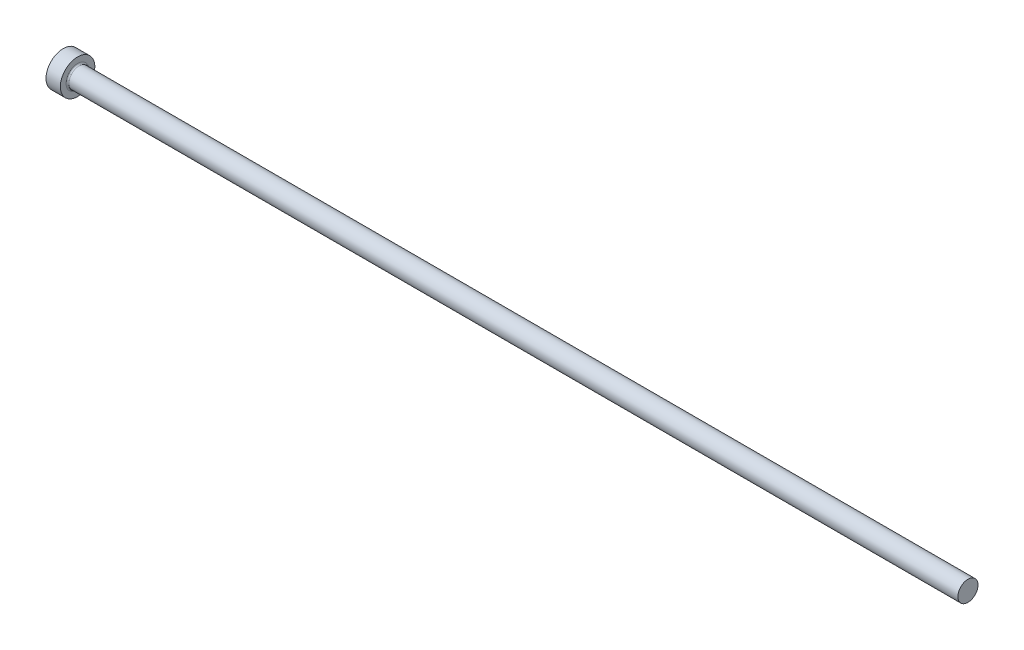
ISO-10303-21;
HEADER;
FILE_DESCRIPTION(('STEP AP214'),'2;1');
FILE_NAME('part.step','',(''),(''),'','','');
FILE_SCHEMA(('AUTOMOTIVE_DESIGN { 1 0 10303 214 1 1 1 1 }'));
ENDSEC;
DATA;
#1=APPLICATION_CONTEXT('core data for automotive mechanical design processes');
#2=APPLICATION_PROTOCOL_DEFINITION('international standard','automotive_design',2000,#1);
#3=PRODUCT_CONTEXT('',#1,'mechanical');
#4=PRODUCT('Part','Part','',(#3));
#5=PRODUCT_RELATED_PRODUCT_CATEGORY('part','',(#4));
#6=PRODUCT_DEFINITION_FORMATION('','',#4);
#7=PRODUCT_DEFINITION_CONTEXT('part definition',#1,'design');
#8=PRODUCT_DEFINITION('design','',#6,#7);
#9=PRODUCT_DEFINITION_SHAPE('','',#8);
#10=(LENGTH_UNIT() NAMED_UNIT(*) SI_UNIT(.MILLI.,.METRE.));
#11=(NAMED_UNIT(*) PLANE_ANGLE_UNIT() SI_UNIT($,.RADIAN.));
#12=(NAMED_UNIT(*) SI_UNIT($,.STERADIAN.) SOLID_ANGLE_UNIT());
#13=UNCERTAINTY_MEASURE_WITH_UNIT(LENGTH_MEASURE(1.E-05),#10,'distance_accuracy_value','');
#14=(GEOMETRIC_REPRESENTATION_CONTEXT(3) GLOBAL_UNCERTAINTY_ASSIGNED_CONTEXT((#13)) GLOBAL_UNIT_ASSIGNED_CONTEXT((#10,
#11,#12)) REPRESENTATION_CONTEXT('',''));
#15=CARTESIAN_POINT('',(0.,0.,0.));
#16=DIRECTION('',(0.,0.,1.));
#17=DIRECTION('',(1.,0.,0.));
#18=AXIS2_PLACEMENT_3D('',#15,#16,#17);
#19=CARTESIAN_POINT('',(0.,0.,0.));
#20=DIRECTION('',(-1.,0.,0.));
#21=DIRECTION('',(0.,-1.,0.));
#22=AXIS2_PLACEMENT_3D('',#19,#20,#21);
#23=PLANE('',#22);
#24=CARTESIAN_POINT('',(0.,0.,0.));
#25=DIRECTION('',(1.,0.,0.));
#26=DIRECTION('',(0.,1.,0.));
#27=AXIS2_PLACEMENT_3D('',#24,#25,#26);
#28=CIRCLE('',#27,6.);
#29=CARTESIAN_POINT('',(0.,6.,0.));
#30=VERTEX_POINT('',#29);
#31=EDGE_CURVE('E25',#30,#30,#28,.T.);
#32=ORIENTED_EDGE('',*,*,#31,.F.);
#33=EDGE_LOOP('',(#32));
#34=FACE_BOUND('',#33,.T.);
#35=ADVANCED_FACE('F14',(#34),#23,.T.);
#36=CARTESIAN_POINT('',(315.,0.,0.));
#37=DIRECTION('',(1.,0.,0.));
#38=DIRECTION('',(0.,1.,0.));
#39=AXIS2_PLACEMENT_3D('',#36,#37,#38);
#40=CYLINDRICAL_SURFACE('',#39,6.);
#41=ORIENTED_EDGE('',*,*,#31,.T.);
#42=EDGE_LOOP('',(#41));
#43=FACE_BOUND('',#42,.T.);
#44=CARTESIAN_POINT('',(5.,0.,0.));
#45=DIRECTION('',(1.,0.,0.));
#46=DIRECTION('',(0.,1.,0.));
#47=AXIS2_PLACEMENT_3D('',#44,#45,#46);
#48=CIRCLE('',#47,6.);
#49=CARTESIAN_POINT('',(5.,6.,0.));
#50=VERTEX_POINT('',#49);
#51=EDGE_CURVE('E29',#50,#50,#48,.T.);
#52=ORIENTED_EDGE('',*,*,#51,.F.);
#53=EDGE_LOOP('',(#52));
#54=FACE_BOUND('',#53,.T.);
#55=ADVANCED_FACE('F51',(#43,#54),#40,.T.);
#56=CARTESIAN_POINT('',(5.,6.,0.));
#57=DIRECTION('',(1.,0.,0.));
#58=DIRECTION('',(0.,1.,0.));
#59=AXIS2_PLACEMENT_3D('',#56,#57,#58);
#60=PLANE('',#59);
#61=CARTESIAN_POINT('',(5.,0.,0.));
#62=DIRECTION('',(1.,0.,0.));
#63=DIRECTION('',(0.,1.,0.));
#64=AXIS2_PLACEMENT_3D('',#61,#62,#63);
#65=CIRCLE('',#64,4.);
#66=CARTESIAN_POINT('',(5.,4.,0.));
#67=VERTEX_POINT('',#66);
#68=EDGE_CURVE('E9',#67,#67,#65,.F.);
#69=ORIENTED_EDGE('',*,*,#68,.T.);
#70=EDGE_LOOP('',(#69));
#71=FACE_BOUND('',#70,.T.);
#72=ORIENTED_EDGE('',*,*,#51,.T.);
#73=EDGE_LOOP('',(#72));
#74=FACE_BOUND('',#73,.T.);
#75=ADVANCED_FACE('F42',(#71,#74),#60,.T.);
#76=CARTESIAN_POINT('',(315.,0.,0.));
#77=DIRECTION('',(1.,0.,0.));
#78=DIRECTION('',(0.,1.,0.));
#79=AXIS2_PLACEMENT_3D('',#76,#77,#78);
#80=CYLINDRICAL_SURFACE('',#79,3.49999999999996);
#81=CARTESIAN_POINT('',(5.5,0.,0.));
#82=DIRECTION('',(1.,0.,0.));
#83=DIRECTION('',(0.,1.,0.));
#84=AXIS2_PLACEMENT_3D('',#81,#82,#83);
#85=CIRCLE('',#84,3.49999999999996);
#86=CARTESIAN_POINT('',(5.5,3.49999999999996,0.));
#87=VERTEX_POINT('',#86);
#88=EDGE_CURVE('E21',#87,#87,#85,.T.);
#89=ORIENTED_EDGE('',*,*,#88,.T.);
#90=EDGE_LOOP('',(#89));
#91=FACE_BOUND('',#90,.T.);
#92=CARTESIAN_POINT('',(315.,0.,0.));
#93=DIRECTION('',(1.,0.,0.));
#94=DIRECTION('',(0.,1.,0.));
#95=AXIS2_PLACEMENT_3D('',#92,#93,#94);
#96=CIRCLE('',#95,3.49999999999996);
#97=CARTESIAN_POINT('',(315.,3.49999999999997,0.));
#98=VERTEX_POINT('',#97);
#99=EDGE_CURVE('E34',#98,#98,#96,.T.);
#100=ORIENTED_EDGE('',*,*,#99,.F.);
#101=EDGE_LOOP('',(#100));
#102=FACE_BOUND('',#101,.T.);
#103=ADVANCED_FACE('F40',(#91,#102),#80,.T.);
#104=CARTESIAN_POINT('',(315.,3.5,0.));
#105=DIRECTION('',(1.,0.,0.));
#106=DIRECTION('',(0.,1.,0.));
#107=AXIS2_PLACEMENT_3D('',#104,#105,#106);
#108=PLANE('',#107);
#109=ORIENTED_EDGE('',*,*,#99,.T.);
#110=EDGE_LOOP('',(#109));
#111=FACE_BOUND('',#110,.T.);
#112=ADVANCED_FACE('F38',(#111),#108,.T.);
#113=CARTESIAN_POINT('',(5.5,0.,0.));
#114=DIRECTION('',(1.,0.,0.));
#115=DIRECTION('',(0.,1.,0.));
#116=AXIS2_PLACEMENT_3D('',#113,#114,#115);
#117=TOROIDAL_SURFACE('',#116,4.,0.5);
#118=ORIENTED_EDGE('',*,*,#68,.F.);
#119=EDGE_LOOP('',(#118));
#120=FACE_BOUND('',#119,.T.);
#121=ORIENTED_EDGE('',*,*,#88,.F.);
#122=EDGE_LOOP('',(#121));
#123=FACE_BOUND('',#122,.T.);
#124=ADVANCED_FACE('F16',(#120,#123),#117,.F.);
#125=CLOSED_SHELL('',(#35,#55,#75,#103,#112,#124));
#126=MANIFOLD_SOLID_BREP('B1',#125);
#127=ADVANCED_BREP_SHAPE_REPRESENTATION('',(#18,#126),#14);
#128=SHAPE_DEFINITION_REPRESENTATION(#9,#127);
ENDSEC;
END-ISO-10303-21;
